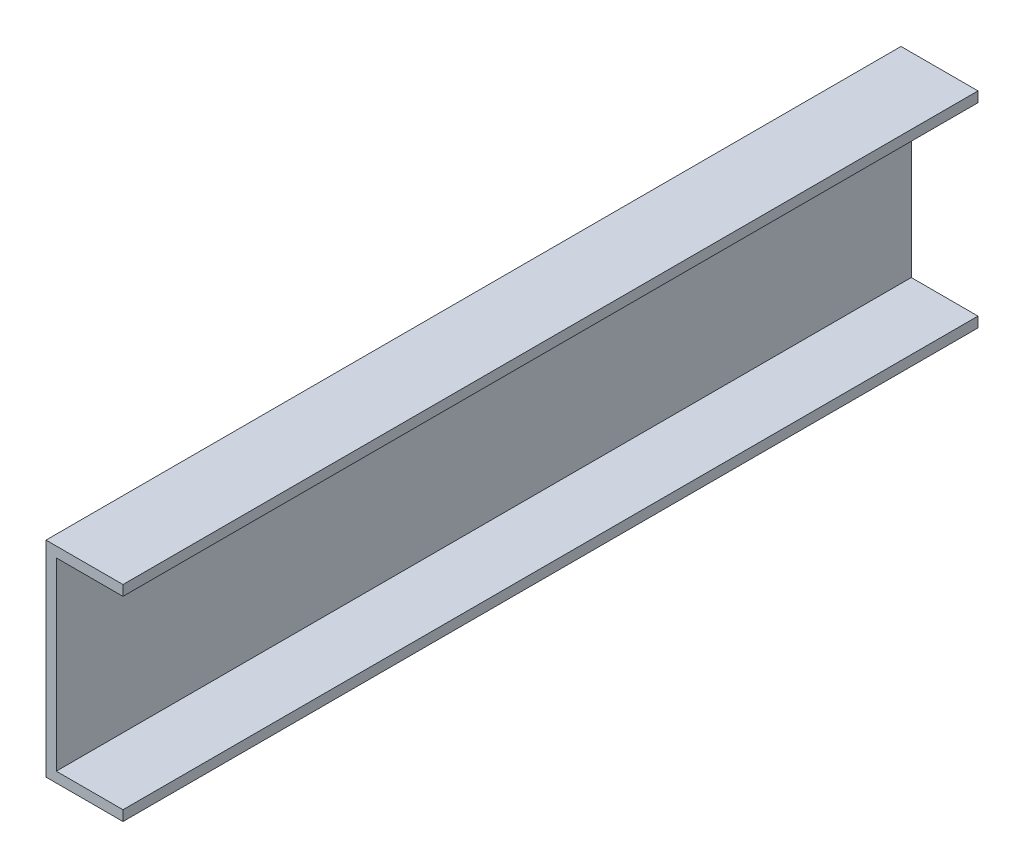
ISO-10303-21;
HEADER;
FILE_DESCRIPTION(('STEP AP214'),'2;1');
FILE_NAME('part.step','',(''),(''),'','','');
FILE_SCHEMA(('AUTOMOTIVE_DESIGN { 1 0 10303 214 1 1 1 1 }'));
ENDSEC;
DATA;
#1=APPLICATION_CONTEXT('core data for automotive mechanical design processes');
#2=APPLICATION_PROTOCOL_DEFINITION('international standard','automotive_design',2000,#1);
#3=PRODUCT_CONTEXT('',#1,'mechanical');
#4=PRODUCT('Part','Part','',(#3));
#5=PRODUCT_RELATED_PRODUCT_CATEGORY('part','',(#4));
#6=PRODUCT_DEFINITION_FORMATION('','',#4);
#7=PRODUCT_DEFINITION_CONTEXT('part definition',#1,'design');
#8=PRODUCT_DEFINITION('design','',#6,#7);
#9=PRODUCT_DEFINITION_SHAPE('','',#8);
#10=(LENGTH_UNIT() NAMED_UNIT(*) SI_UNIT(.MILLI.,.METRE.));
#11=(NAMED_UNIT(*) PLANE_ANGLE_UNIT() SI_UNIT($,.RADIAN.));
#12=(NAMED_UNIT(*) SI_UNIT($,.STERADIAN.) SOLID_ANGLE_UNIT());
#13=UNCERTAINTY_MEASURE_WITH_UNIT(LENGTH_MEASURE(1.E-05),#10,'distance_accuracy_value','');
#14=(GEOMETRIC_REPRESENTATION_CONTEXT(3) GLOBAL_UNCERTAINTY_ASSIGNED_CONTEXT((#13)) GLOBAL_UNIT_ASSIGNED_CONTEXT((#10,
#11,#12)) REPRESENTATION_CONTEXT('',''));
#15=CARTESIAN_POINT('',(0.,0.,0.));
#16=DIRECTION('',(0.,0.,1.));
#17=DIRECTION('',(1.,0.,0.));
#18=AXIS2_PLACEMENT_3D('',#15,#16,#17);
#19=CARTESIAN_POINT('',(75.,10.,416.5));
#20=DIRECTION('',(-1.,0.,0.));
#21=DIRECTION('',(0.,0.,1.));
#22=AXIS2_PLACEMENT_3D('',#19,#20,#21);
#23=PLANE('',#22);
#24=DIRECTION('',(0.,1.,0.));
#25=VECTOR('',#24,1.);
#26=CARTESIAN_POINT('',(75.,10.,-416.5));
#27=LINE('',#26,#25);
#28=CARTESIAN_POINT('',(75.,0.,-416.5));
#29=VERTEX_POINT('',#28);
#30=CARTESIAN_POINT('',(75.,10.,-416.5));
#31=VERTEX_POINT('',#30);
#32=EDGE_CURVE('E129',#29,#31,#27,.T.);
#33=ORIENTED_EDGE('',*,*,#32,.T.);
#34=DIRECTION('',(0.,0.,-1.));
#35=VECTOR('',#34,1.);
#36=CARTESIAN_POINT('',(75.,10.,416.5));
#37=LINE('',#36,#35);
#38=CARTESIAN_POINT('',(75.,10.,416.5));
#39=VERTEX_POINT('',#38);
#40=EDGE_CURVE('E11',#39,#31,#37,.T.);
#41=ORIENTED_EDGE('',*,*,#40,.F.);
#42=DIRECTION('',(0.,1.,0.));
#43=VECTOR('',#42,1.);
#44=CARTESIAN_POINT('',(75.,10.,416.5));
#45=LINE('',#44,#43);
#46=CARTESIAN_POINT('',(75.,0.,416.5));
#47=VERTEX_POINT('',#46);
#48=EDGE_CURVE('E143',#47,#39,#45,.T.);
#49=ORIENTED_EDGE('',*,*,#48,.F.);
#50=DIRECTION('',(0.,0.,-1.));
#51=VECTOR('',#50,1.);
#52=CARTESIAN_POINT('',(75.,0.,416.5));
#53=LINE('',#52,#51);
#54=EDGE_CURVE('E125',#47,#29,#53,.T.);
#55=ORIENTED_EDGE('',*,*,#54,.T.);
#56=EDGE_LOOP('',(#33,#41,#49,#55));
#57=FACE_BOUND('',#56,.T.);
#58=ADVANCED_FACE('F33',(#57),#23,.F.);
#59=CARTESIAN_POINT('',(10.,10.,416.5));
#60=DIRECTION('',(0.,-1.,0.));
#61=DIRECTION('',(0.,0.,-1.));
#62=AXIS2_PLACEMENT_3D('',#59,#60,#61);
#63=PLANE('',#62);
#64=DIRECTION('',(-1.,0.,0.));
#65=VECTOR('',#64,1.);
#66=CARTESIAN_POINT('',(10.,10.,-416.5));
#67=LINE('',#66,#65);
#68=CARTESIAN_POINT('',(10.,10.,-416.5));
#69=VERTEX_POINT('',#68);
#70=EDGE_CURVE('E132',#31,#69,#67,.T.);
#71=ORIENTED_EDGE('',*,*,#70,.T.);
#72=DIRECTION('',(0.,0.,-1.));
#73=VECTOR('',#72,1.);
#74=CARTESIAN_POINT('',(10.,10.,416.5));
#75=LINE('',#74,#73);
#76=CARTESIAN_POINT('',(10.,10.,416.5));
#77=VERTEX_POINT('',#76);
#78=EDGE_CURVE('E41',#77,#69,#75,.T.);
#79=ORIENTED_EDGE('',*,*,#78,.F.);
#80=DIRECTION('',(-1.,0.,0.));
#81=VECTOR('',#80,1.);
#82=CARTESIAN_POINT('',(10.,10.,416.5));
#83=LINE('',#82,#81);
#84=EDGE_CURVE('E92',#39,#77,#83,.T.);
#85=ORIENTED_EDGE('',*,*,#84,.F.);
#86=ORIENTED_EDGE('',*,*,#40,.T.);
#87=EDGE_LOOP('',(#71,#79,#85,#86));
#88=FACE_BOUND('',#87,.T.);
#89=ADVANCED_FACE('F178',(#88),#63,.F.);
#90=CARTESIAN_POINT('',(9.99999999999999,190.,416.5));
#91=DIRECTION('',(-1.,0.,0.));
#92=DIRECTION('',(0.,-1.,0.));
#93=AXIS2_PLACEMENT_3D('',#90,#91,#92);
#94=PLANE('',#93);
#95=DIRECTION('',(0.,1.,0.));
#96=VECTOR('',#95,1.);
#97=CARTESIAN_POINT('',(9.99999999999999,190.,-416.5));
#98=LINE('',#97,#96);
#99=CARTESIAN_POINT('',(9.99999999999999,190.,-416.5));
#100=VERTEX_POINT('',#99);
#101=EDGE_CURVE('E134',#69,#100,#98,.T.);
#102=ORIENTED_EDGE('',*,*,#101,.T.);
#103=DIRECTION('',(0.,0.,-1.));
#104=VECTOR('',#103,1.);
#105=CARTESIAN_POINT('',(9.99999999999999,190.,416.5));
#106=LINE('',#105,#104);
#107=CARTESIAN_POINT('',(9.99999999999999,190.,416.5));
#108=VERTEX_POINT('',#107);
#109=EDGE_CURVE('E150',#108,#100,#106,.T.);
#110=ORIENTED_EDGE('',*,*,#109,.F.);
#111=DIRECTION('',(0.,1.,0.));
#112=VECTOR('',#111,1.);
#113=CARTESIAN_POINT('',(9.99999999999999,190.,416.5));
#114=LINE('',#113,#112);
#115=EDGE_CURVE('E158',#77,#108,#114,.T.);
#116=ORIENTED_EDGE('',*,*,#115,.F.);
#117=ORIENTED_EDGE('',*,*,#78,.T.);
#118=EDGE_LOOP('',(#102,#110,#116,#117));
#119=FACE_BOUND('',#118,.T.);
#120=ADVANCED_FACE('F156',(#119),#94,.F.);
#121=CARTESIAN_POINT('',(75.,190.,416.5));
#122=DIRECTION('',(0.,1.,0.));
#123=DIRECTION('',(0.,0.,1.));
#124=AXIS2_PLACEMENT_3D('',#121,#122,#123);
#125=PLANE('',#124);
#126=DIRECTION('',(1.,0.,0.));
#127=VECTOR('',#126,1.);
#128=CARTESIAN_POINT('',(75.,190.,-416.5));
#129=LINE('',#128,#127);
#130=CARTESIAN_POINT('',(75.,190.,-416.5));
#131=VERTEX_POINT('',#130);
#132=EDGE_CURVE('E136',#100,#131,#129,.T.);
#133=ORIENTED_EDGE('',*,*,#132,.T.);
#134=DIRECTION('',(0.,0.,-1.));
#135=VECTOR('',#134,1.);
#136=CARTESIAN_POINT('',(75.,190.,416.5));
#137=LINE('',#136,#135);
#138=CARTESIAN_POINT('',(75.,190.,416.5));
#139=VERTEX_POINT('',#138);
#140=EDGE_CURVE('E147',#139,#131,#137,.T.);
#141=ORIENTED_EDGE('',*,*,#140,.F.);
#142=DIRECTION('',(1.,0.,0.));
#143=VECTOR('',#142,1.);
#144=CARTESIAN_POINT('',(75.,190.,416.5));
#145=LINE('',#144,#143);
#146=EDGE_CURVE('E170',#108,#139,#145,.T.);
#147=ORIENTED_EDGE('',*,*,#146,.F.);
#148=ORIENTED_EDGE('',*,*,#109,.T.);
#149=EDGE_LOOP('',(#133,#141,#147,#148));
#150=FACE_BOUND('',#149,.T.);
#151=ADVANCED_FACE('F166',(#150),#125,.F.);
#152=CARTESIAN_POINT('',(75.,200.,416.5));
#153=DIRECTION('',(-1.,0.,0.));
#154=DIRECTION('',(0.,-1.,0.));
#155=AXIS2_PLACEMENT_3D('',#152,#153,#154);
#156=PLANE('',#155);
#157=DIRECTION('',(0.,1.,0.));
#158=VECTOR('',#157,1.);
#159=CARTESIAN_POINT('',(75.,200.,-416.5));
#160=LINE('',#159,#158);
#161=CARTESIAN_POINT('',(75.,200.,-416.5));
#162=VERTEX_POINT('',#161);
#163=EDGE_CURVE('E138',#131,#162,#160,.T.);
#164=ORIENTED_EDGE('',*,*,#163,.T.);
#165=DIRECTION('',(0.,0.,-1.));
#166=VECTOR('',#165,1.);
#167=CARTESIAN_POINT('',(75.,200.,416.5));
#168=LINE('',#167,#166);
#169=CARTESIAN_POINT('',(75.,200.,416.5));
#170=VERTEX_POINT('',#169);
#171=EDGE_CURVE('E120',#170,#162,#168,.T.);
#172=ORIENTED_EDGE('',*,*,#171,.F.);
#173=DIRECTION('',(0.,1.,0.));
#174=VECTOR('',#173,1.);
#175=CARTESIAN_POINT('',(75.,200.,416.5));
#176=LINE('',#175,#174);
#177=EDGE_CURVE('E111',#139,#170,#176,.T.);
#178=ORIENTED_EDGE('',*,*,#177,.F.);
#179=ORIENTED_EDGE('',*,*,#140,.T.);
#180=EDGE_LOOP('',(#164,#172,#178,#179));
#181=FACE_BOUND('',#180,.T.);
#182=ADVANCED_FACE('F169',(#181),#156,.F.);
#183=CARTESIAN_POINT('',(0.,200.,416.5));
#184=DIRECTION('',(0.,-1.,0.));
#185=DIRECTION('',(0.,0.,-1.));
#186=AXIS2_PLACEMENT_3D('',#183,#184,#185);
#187=PLANE('',#186);
#188=DIRECTION('',(-1.,0.,0.));
#189=VECTOR('',#188,1.);
#190=CARTESIAN_POINT('',(0.,200.,-416.5));
#191=LINE('',#190,#189);
#192=CARTESIAN_POINT('',(0.,200.,-416.5));
#193=VERTEX_POINT('',#192);
#194=EDGE_CURVE('E119',#162,#193,#191,.T.);
#195=ORIENTED_EDGE('',*,*,#194,.T.);
#196=DIRECTION('',(0.,0.,-1.));
#197=VECTOR('',#196,1.);
#198=CARTESIAN_POINT('',(0.,200.,416.5));
#199=LINE('',#198,#197);
#200=CARTESIAN_POINT('',(0.,200.,416.5));
#201=VERTEX_POINT('',#200);
#202=EDGE_CURVE('E116',#201,#193,#199,.T.);
#203=ORIENTED_EDGE('',*,*,#202,.F.);
#204=DIRECTION('',(-1.,0.,0.));
#205=VECTOR('',#204,1.);
#206=CARTESIAN_POINT('',(0.,200.,416.5));
#207=LINE('',#206,#205);
#208=EDGE_CURVE('E105',#170,#201,#207,.T.);
#209=ORIENTED_EDGE('',*,*,#208,.F.);
#210=ORIENTED_EDGE('',*,*,#171,.T.);
#211=EDGE_LOOP('',(#195,#203,#209,#210));
#212=FACE_BOUND('',#211,.T.);
#213=ADVANCED_FACE('F117',(#212),#187,.F.);
#214=CARTESIAN_POINT('',(0.,0.,416.5));
#215=DIRECTION('',(1.,0.,0.));
#216=DIRECTION('',(0.,0.,-1.));
#217=AXIS2_PLACEMENT_3D('',#214,#215,#216);
#218=PLANE('',#217);
#219=DIRECTION('',(0.,-1.,0.));
#220=VECTOR('',#219,1.);
#221=CARTESIAN_POINT('',(0.,0.,-416.5));
#222=LINE('',#221,#220);
#223=CARTESIAN_POINT('',(0.,0.,-416.5));
#224=VERTEX_POINT('',#223);
#225=EDGE_CURVE('E78',#193,#224,#222,.T.);
#226=ORIENTED_EDGE('',*,*,#225,.T.);
#227=DIRECTION('',(0.,0.,-1.));
#228=VECTOR('',#227,1.);
#229=CARTESIAN_POINT('',(0.,0.,416.5));
#230=LINE('',#229,#228);
#231=CARTESIAN_POINT('',(0.,0.,416.5));
#232=VERTEX_POINT('',#231);
#233=EDGE_CURVE('E121',#232,#224,#230,.T.);
#234=ORIENTED_EDGE('',*,*,#233,.F.);
#235=DIRECTION('',(0.,-1.,0.));
#236=VECTOR('',#235,1.);
#237=CARTESIAN_POINT('',(0.,0.,416.5));
#238=LINE('',#237,#236);
#239=EDGE_CURVE('E109',#201,#232,#238,.T.);
#240=ORIENTED_EDGE('',*,*,#239,.F.);
#241=ORIENTED_EDGE('',*,*,#202,.T.);
#242=EDGE_LOOP('',(#226,#234,#240,#241));
#243=FACE_BOUND('',#242,.T.);
#244=ADVANCED_FACE('F123',(#243),#218,.F.);
#245=CARTESIAN_POINT('',(75.,0.,416.5));
#246=DIRECTION('',(0.,1.,0.));
#247=DIRECTION('',(-1.,0.,0.));
#248=AXIS2_PLACEMENT_3D('',#245,#246,#247);
#249=PLANE('',#248);
#250=DIRECTION('',(1.,0.,0.));
#251=VECTOR('',#250,1.);
#252=CARTESIAN_POINT('',(75.,0.,-416.5));
#253=LINE('',#252,#251);
#254=EDGE_CURVE('E84',#224,#29,#253,.T.);
#255=ORIENTED_EDGE('',*,*,#254,.T.);
#256=ORIENTED_EDGE('',*,*,#54,.F.);
#257=DIRECTION('',(1.,0.,0.));
#258=VECTOR('',#257,1.);
#259=CARTESIAN_POINT('',(75.,0.,416.5));
#260=LINE('',#259,#258);
#261=EDGE_CURVE('E49',#232,#47,#260,.T.);
#262=ORIENTED_EDGE('',*,*,#261,.F.);
#263=ORIENTED_EDGE('',*,*,#233,.T.);
#264=EDGE_LOOP('',(#255,#256,#262,#263));
#265=FACE_BOUND('',#264,.T.);
#266=ADVANCED_FACE('F194',(#265),#249,.F.);
#267=CARTESIAN_POINT('',(0.,0.,416.5));
#268=DIRECTION('',(0.,0.,-1.));
#269=DIRECTION('',(-1.,0.,0.));
#270=AXIS2_PLACEMENT_3D('',#267,#268,#269);
#271=PLANE('',#270);
#272=ORIENTED_EDGE('',*,*,#48,.T.);
#273=ORIENTED_EDGE('',*,*,#84,.T.);
#274=ORIENTED_EDGE('',*,*,#115,.T.);
#275=ORIENTED_EDGE('',*,*,#146,.T.);
#276=ORIENTED_EDGE('',*,*,#177,.T.);
#277=ORIENTED_EDGE('',*,*,#208,.T.);
#278=ORIENTED_EDGE('',*,*,#239,.T.);
#279=ORIENTED_EDGE('',*,*,#261,.T.);
#280=EDGE_LOOP('',(#272,#273,#274,#275,#276,#277,#278,#279));
#281=FACE_BOUND('',#280,.T.);
#282=ADVANCED_FACE('F107',(#281),#271,.F.);
#283=CARTESIAN_POINT('',(0.,0.,-416.5));
#284=DIRECTION('',(0.,0.,-1.));
#285=DIRECTION('',(-1.,0.,0.));
#286=AXIS2_PLACEMENT_3D('',#283,#284,#285);
#287=PLANE('',#286);
#288=ORIENTED_EDGE('',*,*,#32,.F.);
#289=ORIENTED_EDGE('',*,*,#254,.F.);
#290=ORIENTED_EDGE('',*,*,#225,.F.);
#291=ORIENTED_EDGE('',*,*,#194,.F.);
#292=ORIENTED_EDGE('',*,*,#163,.F.);
#293=ORIENTED_EDGE('',*,*,#132,.F.);
#294=ORIENTED_EDGE('',*,*,#101,.F.);
#295=ORIENTED_EDGE('',*,*,#70,.F.);
#296=EDGE_LOOP('',(#288,#289,#290,#291,#292,#293,#294,#295));
#297=FACE_BOUND('',#296,.T.);
#298=ADVANCED_FACE('F162',(#297),#287,.T.);
#299=CLOSED_SHELL('',(#58,#89,#120,#151,#182,#213,#244,#266,#282,#298));
#300=MANIFOLD_SOLID_BREP('B2',#299);
#301=ADVANCED_BREP_SHAPE_REPRESENTATION('',(#18,#300),#14);
#302=SHAPE_DEFINITION_REPRESENTATION(#9,#301);
ENDSEC;
END-ISO-10303-21;
